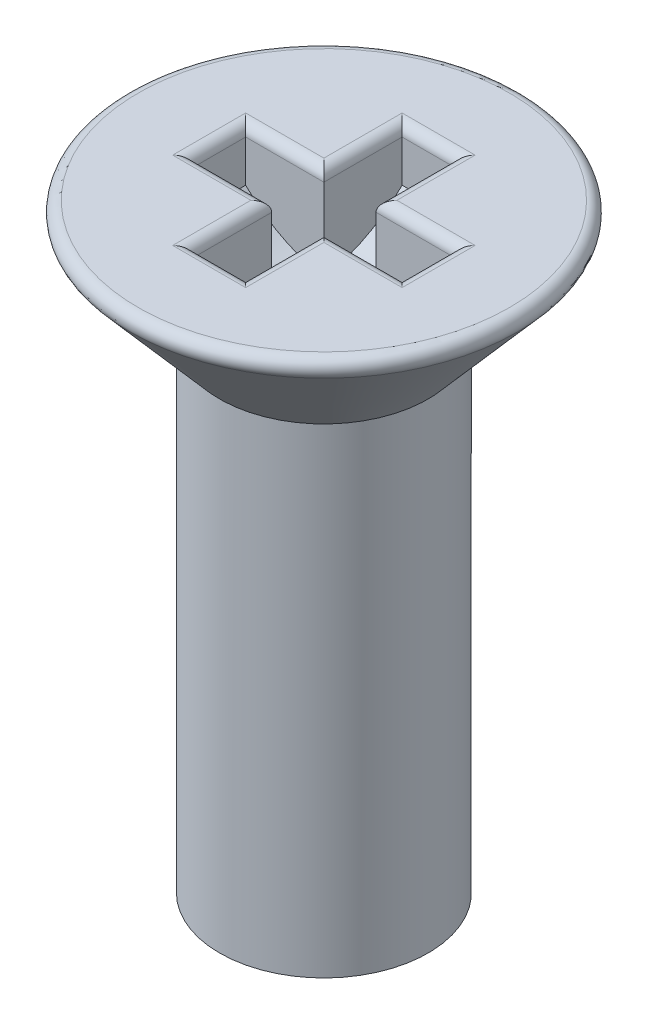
ISO-10303-21;
HEADER;
FILE_DESCRIPTION(('STEP AP214'),'2;1');
FILE_NAME('part.step','',(''),(''),'','','');
FILE_SCHEMA(('AUTOMOTIVE_DESIGN { 1 0 10303 214 1 1 1 1 }'));
ENDSEC;
DATA;
#1=APPLICATION_CONTEXT('core data for automotive mechanical design processes');
#2=APPLICATION_PROTOCOL_DEFINITION('international standard','automotive_design',2000,#1);
#3=PRODUCT_CONTEXT('',#1,'mechanical');
#4=PRODUCT('Part','Part','',(#3));
#5=PRODUCT_RELATED_PRODUCT_CATEGORY('part','',(#4));
#6=PRODUCT_DEFINITION_FORMATION('','',#4);
#7=PRODUCT_DEFINITION_CONTEXT('part definition',#1,'design');
#8=PRODUCT_DEFINITION('design','',#6,#7);
#9=PRODUCT_DEFINITION_SHAPE('','',#8);
#10=(LENGTH_UNIT() NAMED_UNIT(*) SI_UNIT(.MILLI.,.METRE.));
#11=(NAMED_UNIT(*) PLANE_ANGLE_UNIT() SI_UNIT($,.RADIAN.));
#12=(NAMED_UNIT(*) SI_UNIT($,.STERADIAN.) SOLID_ANGLE_UNIT());
#13=UNCERTAINTY_MEASURE_WITH_UNIT(LENGTH_MEASURE(1.E-05),#10,'distance_accuracy_value','');
#14=(GEOMETRIC_REPRESENTATION_CONTEXT(3) GLOBAL_UNCERTAINTY_ASSIGNED_CONTEXT((#13)) GLOBAL_UNIT_ASSIGNED_CONTEXT((#10,
#11,#12)) REPRESENTATION_CONTEXT('',''));
#15=CARTESIAN_POINT('',(0.,0.,0.));
#16=DIRECTION('',(0.,0.,1.));
#17=DIRECTION('',(1.,0.,0.));
#18=AXIS2_PLACEMENT_3D('',#15,#16,#17);
#19=CARTESIAN_POINT('',(20.5,44.5,0.));
#20=DIRECTION('',(0.,-1.,0.));
#21=DIRECTION('',(1.,0.,0.));
#22=AXIS2_PLACEMENT_3D('',#19,#20,#21);
#23=PLANE('',#22);
#24=DIRECTION('',(1.,0.,0.));
#25=VECTOR('',#24,1.);
#26=CARTESIAN_POINT('',(20.5,44.5,-2.2));
#27=LINE('',#26,#25);
#28=CARTESIAN_POINT('',(15.8,44.5,-2.2));
#29=VERTEX_POINT('',#28);
#30=CARTESIAN_POINT('',(17.2,44.5,-2.2));
#31=VERTEX_POINT('',#30);
#32=EDGE_CURVE('E302',#29,#31,#27,.T.);
#33=ORIENTED_EDGE('',*,*,#32,.T.);
#34=DIRECTION('',(0.,0.,1.));
#35=VECTOR('',#34,1.);
#36=CARTESIAN_POINT('',(17.2,44.5,0.));
#37=LINE('',#36,#35);
#38=CARTESIAN_POINT('',(17.2,44.5,-0.699999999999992));
#39=VERTEX_POINT('',#38);
#40=EDGE_CURVE('E304',#31,#39,#37,.T.);
#41=ORIENTED_EDGE('',*,*,#40,.T.);
#42=DIRECTION('',(-1.,0.,0.));
#43=VECTOR('',#42,1.);
#44=CARTESIAN_POINT('',(16.5,44.5,-0.699999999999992));
#45=LINE('',#44,#43);
#46=CARTESIAN_POINT('',(18.7,44.5,-0.699999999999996));
#47=VERTEX_POINT('',#46);
#48=EDGE_CURVE('E282',#39,#47,#45,.F.);
#49=ORIENTED_EDGE('',*,*,#48,.T.);
#50=DIRECTION('',(0.,0.,1.));
#51=VECTOR('',#50,1.);
#52=CARTESIAN_POINT('',(18.7,44.5,0.));
#53=LINE('',#52,#51);
#54=CARTESIAN_POINT('',(18.7,44.5,0.700000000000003));
#55=VERTEX_POINT('',#54);
#56=EDGE_CURVE('E284',#47,#55,#53,.T.);
#57=ORIENTED_EDGE('',*,*,#56,.T.);
#58=DIRECTION('',(-1.,0.,0.));
#59=VECTOR('',#58,1.);
#60=CARTESIAN_POINT('',(20.5,44.5,0.699999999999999));
#61=LINE('',#60,#59);
#62=CARTESIAN_POINT('',(17.2,44.5,0.699999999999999));
#63=VERTEX_POINT('',#62);
#64=EDGE_CURVE('E286',#55,#63,#61,.T.);
#65=ORIENTED_EDGE('',*,*,#64,.T.);
#66=DIRECTION('',(0.,0.,1.));
#67=VECTOR('',#66,1.);
#68=CARTESIAN_POINT('',(17.2,44.5,0.));
#69=LINE('',#68,#67);
#70=CARTESIAN_POINT('',(17.2,44.5,2.2));
#71=VERTEX_POINT('',#70);
#72=EDGE_CURVE('E288',#63,#71,#69,.T.);
#73=ORIENTED_EDGE('',*,*,#72,.T.);
#74=DIRECTION('',(1.,0.,0.));
#75=VECTOR('',#74,1.);
#76=CARTESIAN_POINT('',(20.5,44.5,2.2));
#77=LINE('',#76,#75);
#78=CARTESIAN_POINT('',(15.8,44.5,2.2));
#79=VERTEX_POINT('',#78);
#80=EDGE_CURVE('E290',#71,#79,#77,.F.);
#81=ORIENTED_EDGE('',*,*,#80,.T.);
#82=DIRECTION('',(0.,0.,1.));
#83=VECTOR('',#82,1.);
#84=CARTESIAN_POINT('',(15.8,44.5,0.));
#85=LINE('',#84,#83);
#86=CARTESIAN_POINT('',(15.8,44.5,0.699999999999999));
#87=VERTEX_POINT('',#86);
#88=EDGE_CURVE('E292',#79,#87,#85,.F.);
#89=ORIENTED_EDGE('',*,*,#88,.T.);
#90=DIRECTION('',(-1.,0.,0.));
#91=VECTOR('',#90,1.);
#92=CARTESIAN_POINT('',(20.5,44.5,0.699999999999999));
#93=LINE('',#92,#91);
#94=CARTESIAN_POINT('',(14.3,44.5,0.700000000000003));
#95=VERTEX_POINT('',#94);
#96=EDGE_CURVE('E294',#87,#95,#93,.T.);
#97=ORIENTED_EDGE('',*,*,#96,.T.);
#98=DIRECTION('',(0.,0.,1.));
#99=VECTOR('',#98,1.);
#100=CARTESIAN_POINT('',(14.3,44.5,0.));
#101=LINE('',#100,#99);
#102=CARTESIAN_POINT('',(14.3,44.5,-0.699999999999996));
#103=VERTEX_POINT('',#102);
#104=EDGE_CURVE('E296',#95,#103,#101,.F.);
#105=ORIENTED_EDGE('',*,*,#104,.T.);
#106=DIRECTION('',(-1.,0.,0.));
#107=VECTOR('',#106,1.);
#108=CARTESIAN_POINT('',(16.5,44.5,-0.699999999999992));
#109=LINE('',#108,#107);
#110=CARTESIAN_POINT('',(15.8,44.5,-0.699999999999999));
#111=VERTEX_POINT('',#110);
#112=EDGE_CURVE('E298',#103,#111,#109,.F.);
#113=ORIENTED_EDGE('',*,*,#112,.T.);
#114=DIRECTION('',(0.,0.,1.));
#115=VECTOR('',#114,1.);
#116=CARTESIAN_POINT('',(15.8,44.5,0.));
#117=LINE('',#116,#115);
#118=EDGE_CURVE('E300',#111,#29,#117,.F.);
#119=ORIENTED_EDGE('',*,*,#118,.T.);
#120=EDGE_LOOP('',(#33,#41,#49,#57,#65,#73,#81,#89,#97,#105,#113,#119));
#121=FACE_BOUND('',#120,.T.);
#122=CARTESIAN_POINT('',(16.5,44.5,0.));
#123=DIRECTION('',(0.,-1.,0.));
#124=DIRECTION('',(1.,0.,0.));
#125=AXIS2_PLACEMENT_3D('',#122,#123,#124);
#126=CIRCLE('',#125,3.56114005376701);
#127=CARTESIAN_POINT('',(20.061140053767,44.5,0.));
#128=VERTEX_POINT('',#127);
#129=EDGE_CURVE('E274',#128,#128,#126,.F.);
#130=ORIENTED_EDGE('',*,*,#129,.T.);
#131=EDGE_LOOP('',(#130));
#132=FACE_BOUND('',#131,.T.);
#133=ADVANCED_FACE('F24',(#121,#132),#23,.F.);
#134=CARTESIAN_POINT('',(16.,45.5,0.));
#135=DIRECTION('',(1.,0.,0.));
#136=DIRECTION('',(0.,0.,-1.));
#137=AXIS2_PLACEMENT_3D('',#134,#135,#136);
#138=CYLINDRICAL_SURFACE('',#137,2.82842712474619);
#139=DIRECTION('',(1.,0.,0.));
#140=VECTOR('',#139,1.);
#141=CARTESIAN_POINT('',(16.,42.716117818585,-0.499999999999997));
#142=LINE('',#141,#140);
#143=CARTESIAN_POINT('',(17.,42.716117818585,-0.499999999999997));
#144=VERTEX_POINT('',#143);
#145=CARTESIAN_POINT('',(16.,42.716117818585,-0.499999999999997));
#146=VERTEX_POINT('',#145);
#147=EDGE_CURVE('E477',#144,#146,#142,.F.);
#148=ORIENTED_EDGE('',*,*,#147,.F.);
#149=CARTESIAN_POINT('',(17.,45.5,0.));
#150=DIRECTION('',(1.,0.,0.));
#151=DIRECTION('',(0.,0.,-1.));
#152=AXIS2_PLACEMENT_3D('',#149,#150,#151);
#153=CIRCLE('',#152,2.82842712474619);
#154=CARTESIAN_POINT('',(17.,43.5,-2.));
#155=VERTEX_POINT('',#154);
#156=EDGE_CURVE('E370',#144,#155,#153,.T.);
#157=ORIENTED_EDGE('',*,*,#156,.T.);
#158=DIRECTION('',(1.,0.,0.));
#159=VECTOR('',#158,1.);
#160=CARTESIAN_POINT('',(16.,43.5,-2.));
#161=LINE('',#160,#159);
#162=CARTESIAN_POINT('',(16.,43.5,-2.));
#163=VERTEX_POINT('',#162);
#164=EDGE_CURVE('E262',#163,#155,#161,.T.);
#165=ORIENTED_EDGE('',*,*,#164,.F.);
#166=CARTESIAN_POINT('',(16.,45.5,0.));
#167=DIRECTION('',(1.,0.,0.));
#168=DIRECTION('',(0.,0.,-1.));
#169=AXIS2_PLACEMENT_3D('',#166,#167,#168);
#170=CIRCLE('',#169,2.82842712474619);
#171=EDGE_CURVE('E393',#146,#163,#170,.T.);
#172=ORIENTED_EDGE('',*,*,#171,.F.);
#173=EDGE_LOOP('',(#148,#157,#165,#172));
#174=FACE_BOUND('',#173,.T.);
#175=ADVANCED_FACE('F227',(#174),#138,.F.);
#176=CARTESIAN_POINT('',(16.,45.5,0.));
#177=DIRECTION('',(1.,0.,0.));
#178=DIRECTION('',(0.,0.,-1.));
#179=AXIS2_PLACEMENT_3D('',#176,#177,#178);
#180=PLANE('',#179);
#181=DIRECTION('',(0.,1.,0.));
#182=VECTOR('',#181,1.);
#183=CARTESIAN_POINT('',(16.,44.5,-2.));
#184=LINE('',#183,#182);
#185=CARTESIAN_POINT('',(16.,44.3,-2.));
#186=VERTEX_POINT('',#185);
#187=EDGE_CURVE('E387',#163,#186,#184,.T.);
#188=ORIENTED_EDGE('',*,*,#187,.T.);
#189=DIRECTION('',(0.,0.,1.));
#190=VECTOR('',#189,1.);
#191=CARTESIAN_POINT('',(16.,44.3,0.));
#192=LINE('',#191,#190);
#193=CARTESIAN_POINT('',(16.,44.3,-0.499999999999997));
#194=VERTEX_POINT('',#193);
#195=EDGE_CURVE('E312',#186,#194,#192,.T.);
#196=ORIENTED_EDGE('',*,*,#195,.T.);
#197=DIRECTION('',(0.,-1.,0.));
#198=VECTOR('',#197,1.);
#199=CARTESIAN_POINT('',(16.,45.5,-0.499999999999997));
#200=LINE('',#199,#198);
#201=EDGE_CURVE('E466',#194,#146,#200,.T.);
#202=ORIENTED_EDGE('',*,*,#201,.T.);
#203=ORIENTED_EDGE('',*,*,#171,.T.);
#204=EDGE_LOOP('',(#188,#196,#202,#203));
#205=FACE_BOUND('',#204,.T.);
#206=ADVANCED_FACE('F233',(#205),#180,.T.);
#207=CARTESIAN_POINT('',(17.,45.5,0.));
#208=DIRECTION('',(1.,0.,0.));
#209=DIRECTION('',(0.,0.,-1.));
#210=AXIS2_PLACEMENT_3D('',#207,#208,#209);
#211=PLANE('',#210);
#212=DIRECTION('',(0.,-1.,0.));
#213=VECTOR('',#212,1.);
#214=CARTESIAN_POINT('',(17.,45.5,-0.499999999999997));
#215=LINE('',#214,#213);
#216=CARTESIAN_POINT('',(17.,44.3,-0.499999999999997));
#217=VERTEX_POINT('',#216);
#218=EDGE_CURVE('E280',#217,#144,#215,.T.);
#219=ORIENTED_EDGE('',*,*,#218,.F.);
#220=DIRECTION('',(0.,0.,1.));
#221=VECTOR('',#220,1.);
#222=CARTESIAN_POINT('',(17.,44.3,0.));
#223=LINE('',#222,#221);
#224=CARTESIAN_POINT('',(17.,44.3,-2.));
#225=VERTEX_POINT('',#224);
#226=EDGE_CURVE('E307',#217,#225,#223,.F.);
#227=ORIENTED_EDGE('',*,*,#226,.T.);
#228=DIRECTION('',(0.,1.,0.));
#229=VECTOR('',#228,1.);
#230=CARTESIAN_POINT('',(17.,44.5,-2.));
#231=LINE('',#230,#229);
#232=EDGE_CURVE('E388',#155,#225,#231,.T.);
#233=ORIENTED_EDGE('',*,*,#232,.F.);
#234=ORIENTED_EDGE('',*,*,#156,.F.);
#235=EDGE_LOOP('',(#219,#227,#233,#234));
#236=FACE_BOUND('',#235,.T.);
#237=ADVANCED_FACE('F251',(#236),#211,.F.);
#238=CARTESIAN_POINT('',(16.5,50.,0.));
#239=DIRECTION('',(0.,1.,0.));
#240=DIRECTION('',(-1.,0.,0.));
#241=AXIS2_PLACEMENT_3D('',#238,#239,#240);
#242=CYLINDRICAL_SURFACE('',#241,2.00000000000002);
#243=CARTESIAN_POINT('',(16.5,33.,0.));
#244=DIRECTION('',(0.,1.,0.));
#245=DIRECTION('',(0.,0.,1.));
#246=AXIS2_PLACEMENT_3D('',#243,#244,#245);
#247=CIRCLE('',#246,2.00000000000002);
#248=CARTESIAN_POINT('',(16.5,33.,2.00000000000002));
#249=VERTEX_POINT('',#248);
#250=EDGE_CURVE('E261',#249,#249,#247,.T.);
#251=ORIENTED_EDGE('',*,*,#250,.T.);
#252=EDGE_LOOP('',(#251));
#253=FACE_BOUND('',#252,.T.);
#254=CARTESIAN_POINT('',(16.5,42.199263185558,0.));
#255=DIRECTION('',(0.,1.,0.));
#256=DIRECTION('',(-1.,0.,0.));
#257=AXIS2_PLACEMENT_3D('',#254,#255,#256);
#258=CIRCLE('',#257,2.00000000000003);
#259=CARTESIAN_POINT('',(14.5,42.199263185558,0.));
#260=VERTEX_POINT('',#259);
#261=EDGE_CURVE('E259',#260,#260,#258,.T.);
#262=ORIENTED_EDGE('',*,*,#261,.F.);
#263=EDGE_LOOP('',(#262));
#264=FACE_BOUND('',#263,.T.);
#265=ADVANCED_FACE('F26',(#253,#264),#242,.T.);
#266=CARTESIAN_POINT('',(16.5,42.199263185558,0.));
#267=DIRECTION('',(0.,1.,0.));
#268=DIRECTION('',(-1.,0.,0.));
#269=AXIS2_PLACEMENT_3D('',#266,#267,#268);
#270=CONICAL_SURFACE('',#269,2.00000000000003,0.715584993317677);
#271=CARTESIAN_POINT('',(16.5,44.1687881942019,0.));
#272=DIRECTION('',(0.,-1.,0.));
#273=DIRECTION('',(1.,0.,0.));
#274=AXIS2_PLACEMENT_3D('',#271,#272,#273);
#275=CIRCLE('',#274,3.71208196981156);
#276=CARTESIAN_POINT('',(20.2120819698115,44.1687881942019,0.));
#277=VERTEX_POINT('',#276);
#278=EDGE_CURVE('E256',#277,#277,#275,.T.);
#279=ORIENTED_EDGE('',*,*,#278,.T.);
#280=EDGE_LOOP('',(#279));
#281=FACE_BOUND('',#280,.T.);
#282=ORIENTED_EDGE('',*,*,#261,.T.);
#283=EDGE_LOOP('',(#282));
#284=FACE_BOUND('',#283,.T.);
#285=ADVANCED_FACE('F242',(#281,#284),#270,.T.);
#286=CARTESIAN_POINT('',(18.5,32.5,0.));
#287=DIRECTION('',(0.,1.,0.));
#288=DIRECTION('',(-1.,0.,0.));
#289=AXIS2_PLACEMENT_3D('',#286,#287,#288);
#290=PLANE('',#289);
#291=CARTESIAN_POINT('',(16.5,32.5,0.));
#292=DIRECTION('',(0.,1.,0.));
#293=DIRECTION('',(-1.,0.,0.));
#294=AXIS2_PLACEMENT_3D('',#291,#292,#293);
#295=CIRCLE('',#294,1.13397459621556);
#296=CARTESIAN_POINT('',(15.3660254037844,32.5,0.));
#297=VERTEX_POINT('',#296);
#298=EDGE_CURVE('E265',#297,#297,#295,.F.);
#299=ORIENTED_EDGE('',*,*,#298,.T.);
#300=EDGE_LOOP('',(#299));
#301=FACE_BOUND('',#300,.T.);
#302=ADVANCED_FACE('F240',(#301),#290,.F.);
#303=CARTESIAN_POINT('',(16.5,33.,0.));
#304=DIRECTION('',(0.,1.,0.));
#305=DIRECTION('',(0.,0.,1.));
#306=AXIS2_PLACEMENT_3D('',#303,#304,#305);
#307=CONICAL_SURFACE('',#306,2.00000000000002,1.0471975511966);
#308=ORIENTED_EDGE('',*,*,#298,.F.);
#309=EDGE_LOOP('',(#308));
#310=FACE_BOUND('',#309,.T.);
#311=ORIENTED_EDGE('',*,*,#250,.F.);
#312=EDGE_LOOP('',(#311));
#313=FACE_BOUND('',#312,.T.);
#314=ADVANCED_FACE('F249',(#310,#313),#307,.T.);
#315=CARTESIAN_POINT('',(16.,44.5,2.));
#316=DIRECTION('',(0.,0.,1.));
#317=DIRECTION('',(0.,-1.,0.));
#318=AXIS2_PLACEMENT_3D('',#315,#316,#317);
#319=PLANE('',#318);
#320=DIRECTION('',(0.,-1.,0.));
#321=VECTOR('',#320,1.);
#322=CARTESIAN_POINT('',(16.,44.5,2.));
#323=LINE('',#322,#321);
#324=CARTESIAN_POINT('',(16.,44.3,2.));
#325=VERTEX_POINT('',#324);
#326=CARTESIAN_POINT('',(16.,43.5,2.00000000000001));
#327=VERTEX_POINT('',#326);
#328=EDGE_CURVE('E432',#325,#327,#323,.T.);
#329=ORIENTED_EDGE('',*,*,#328,.F.);
#330=DIRECTION('',(1.,0.,0.));
#331=VECTOR('',#330,1.);
#332=CARTESIAN_POINT('',(16.,44.3,2.));
#333=LINE('',#332,#331);
#334=CARTESIAN_POINT('',(17.,44.3,2.));
#335=VERTEX_POINT('',#334);
#336=EDGE_CURVE('E321',#325,#335,#333,.T.);
#337=ORIENTED_EDGE('',*,*,#336,.T.);
#338=DIRECTION('',(0.,-1.,0.));
#339=VECTOR('',#338,1.);
#340=CARTESIAN_POINT('',(17.,44.5,2.));
#341=LINE('',#340,#339);
#342=CARTESIAN_POINT('',(17.,43.5,2.));
#343=VERTEX_POINT('',#342);
#344=EDGE_CURVE('E331',#335,#343,#341,.T.);
#345=ORIENTED_EDGE('',*,*,#344,.T.);
#346=DIRECTION('',(1.,0.,0.));
#347=VECTOR('',#346,1.);
#348=CARTESIAN_POINT('',(16.,43.5,2.00000000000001));
#349=LINE('',#348,#347);
#350=EDGE_CURVE('E268',#327,#343,#349,.T.);
#351=ORIENTED_EDGE('',*,*,#350,.F.);
#352=EDGE_LOOP('',(#329,#337,#345,#351));
#353=FACE_BOUND('',#352,.T.);
#354=ADVANCED_FACE('F435',(#353),#319,.F.);
#355=CARTESIAN_POINT('',(16.,44.5,-2.));
#356=DIRECTION('',(0.,0.,-1.));
#357=DIRECTION('',(0.,1.,0.));
#358=AXIS2_PLACEMENT_3D('',#355,#356,#357);
#359=PLANE('',#358);
#360=ORIENTED_EDGE('',*,*,#232,.T.);
#361=DIRECTION('',(1.,0.,0.));
#362=VECTOR('',#361,1.);
#363=CARTESIAN_POINT('',(16.,44.3,-2.));
#364=LINE('',#363,#362);
#365=EDGE_CURVE('E310',#225,#186,#364,.F.);
#366=ORIENTED_EDGE('',*,*,#365,.T.);
#367=ORIENTED_EDGE('',*,*,#187,.F.);
#368=ORIENTED_EDGE('',*,*,#164,.T.);
#369=EDGE_LOOP('',(#360,#366,#367,#368));
#370=FACE_BOUND('',#369,.T.);
#371=ADVANCED_FACE('F386',(#370),#359,.F.);
#372=CARTESIAN_POINT('',(17.,42.716117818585,0.500000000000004));
#373=VERTEX_POINT('',#372);
#374=EDGE_CURVE('E441',#343,#373,#153,.T.);
#375=ORIENTED_EDGE('',*,*,#374,.T.);
#376=DIRECTION('',(1.,0.,0.));
#377=VECTOR('',#376,1.);
#378=CARTESIAN_POINT('',(16.,42.716117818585,0.500000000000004));
#379=LINE('',#378,#377);
#380=CARTESIAN_POINT('',(16.,42.716117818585,0.500000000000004));
#381=VERTEX_POINT('',#380);
#382=EDGE_CURVE('E200',#373,#381,#379,.F.);
#383=ORIENTED_EDGE('',*,*,#382,.T.);
#384=EDGE_CURVE('E395',#327,#381,#170,.T.);
#385=ORIENTED_EDGE('',*,*,#384,.F.);
#386=ORIENTED_EDGE('',*,*,#350,.T.);
#387=EDGE_LOOP('',(#375,#383,#385,#386));
#388=FACE_BOUND('',#387,.T.);
#389=ADVANCED_FACE('F237',(#388),#138,.F.);
#390=DIRECTION('',(0.,-1.,0.));
#391=VECTOR('',#390,1.);
#392=CARTESIAN_POINT('',(16.,45.5,0.500000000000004));
#393=LINE('',#392,#391);
#394=CARTESIAN_POINT('',(16.,44.3,0.500000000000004));
#395=VERTEX_POINT('',#394);
#396=EDGE_CURVE('E180',#395,#381,#393,.T.);
#397=ORIENTED_EDGE('',*,*,#396,.F.);
#398=DIRECTION('',(0.,0.,1.));
#399=VECTOR('',#398,1.);
#400=CARTESIAN_POINT('',(16.,44.3,0.));
#401=LINE('',#400,#399);
#402=EDGE_CURVE('E319',#395,#325,#401,.T.);
#403=ORIENTED_EDGE('',*,*,#402,.T.);
#404=ORIENTED_EDGE('',*,*,#328,.T.);
#405=ORIENTED_EDGE('',*,*,#384,.T.);
#406=EDGE_LOOP('',(#397,#403,#404,#405));
#407=FACE_BOUND('',#406,.T.);
#408=ADVANCED_FACE('F431',(#407),#180,.T.);
#409=ORIENTED_EDGE('',*,*,#344,.F.);
#410=DIRECTION('',(0.,0.,1.));
#411=VECTOR('',#410,1.);
#412=CARTESIAN_POINT('',(17.,44.3,0.));
#413=LINE('',#412,#411);
#414=CARTESIAN_POINT('',(17.,44.3,0.500000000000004));
#415=VERTEX_POINT('',#414);
#416=EDGE_CURVE('E323',#335,#415,#413,.F.);
#417=ORIENTED_EDGE('',*,*,#416,.T.);
#418=DIRECTION('',(0.,-1.,0.));
#419=VECTOR('',#418,1.);
#420=CARTESIAN_POINT('',(17.,45.5,0.500000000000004));
#421=LINE('',#420,#419);
#422=EDGE_CURVE('E203',#415,#373,#421,.T.);
#423=ORIENTED_EDGE('',*,*,#422,.T.);
#424=ORIENTED_EDGE('',*,*,#374,.F.);
#425=EDGE_LOOP('',(#409,#417,#423,#424));
#426=FACE_BOUND('',#425,.T.);
#427=ADVANCED_FACE('F328',(#426),#211,.F.);
#428=CARTESIAN_POINT('',(16.5,44.3,0.));
#429=DIRECTION('',(0.,-1.,0.));
#430=DIRECTION('',(1.,0.,0.));
#431=AXIS2_PLACEMENT_3D('',#428,#429,#430);
#432=TOROIDAL_SURFACE('',#431,3.56114005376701,0.2);
#433=ORIENTED_EDGE('',*,*,#278,.F.);
#434=EDGE_LOOP('',(#433));
#435=FACE_BOUND('',#434,.T.);
#436=ORIENTED_EDGE('',*,*,#129,.F.);
#437=EDGE_LOOP('',(#436));
#438=FACE_BOUND('',#437,.T.);
#439=ADVANCED_FACE('F215',(#435,#438),#432,.T.);
#440=CARTESIAN_POINT('',(16.5,45.5,-0.499999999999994));
#441=DIRECTION('',(0.,0.,1.));
#442=DIRECTION('',(1.,0.,0.));
#443=AXIS2_PLACEMENT_3D('',#440,#441,#442);
#444=PLANE('',#443);
#445=DIRECTION('',(0.,1.,0.));
#446=VECTOR('',#445,1.);
#447=CARTESIAN_POINT('',(18.5,44.5,-0.499999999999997));
#448=LINE('',#447,#446);
#449=CARTESIAN_POINT('',(18.5,43.5,-0.499999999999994));
#450=VERTEX_POINT('',#449);
#451=CARTESIAN_POINT('',(18.5,44.3,-0.499999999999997));
#452=VERTEX_POINT('',#451);
#453=EDGE_CURVE('E176',#450,#452,#448,.T.);
#454=ORIENTED_EDGE('',*,*,#453,.T.);
#455=DIRECTION('',(-1.,0.,0.));
#456=VECTOR('',#455,1.);
#457=CARTESIAN_POINT('',(16.5,44.3,-0.499999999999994));
#458=LINE('',#457,#456);
#459=EDGE_CURVE('E11',#452,#217,#458,.T.);
#460=ORIENTED_EDGE('',*,*,#459,.T.);
#461=ORIENTED_EDGE('',*,*,#218,.T.);
#462=CARTESIAN_POINT('',(16.5,45.5,-0.499999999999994));
#463=DIRECTION('',(0.,0.,1.));
#464=DIRECTION('',(1.,0.,0.));
#465=AXIS2_PLACEMENT_3D('',#462,#463,#464);
#466=CIRCLE('',#465,2.82842712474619);
#467=EDGE_CURVE('E481',#144,#450,#466,.T.);
#468=ORIENTED_EDGE('',*,*,#467,.T.);
#469=EDGE_LOOP('',(#454,#460,#461,#468));
#470=FACE_BOUND('',#469,.T.);
#471=ADVANCED_FACE('F206',(#470),#444,.T.);
#472=CARTESIAN_POINT('',(16.5,45.5,0.5));
#473=DIRECTION('',(0.,0.,1.));
#474=DIRECTION('',(1.,0.,0.));
#475=AXIS2_PLACEMENT_3D('',#472,#473,#474);
#476=PLANE('',#475);
#477=ORIENTED_EDGE('',*,*,#422,.F.);
#478=DIRECTION('',(-1.,0.,0.));
#479=VECTOR('',#478,1.);
#480=CARTESIAN_POINT('',(16.5,44.3,0.5));
#481=LINE('',#480,#479);
#482=CARTESIAN_POINT('',(18.5,44.3,0.500000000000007));
#483=VERTEX_POINT('',#482);
#484=EDGE_CURVE('E46',#415,#483,#481,.F.);
#485=ORIENTED_EDGE('',*,*,#484,.T.);
#486=DIRECTION('',(0.,1.,0.));
#487=VECTOR('',#486,1.);
#488=CARTESIAN_POINT('',(18.5,44.5,0.500000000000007));
#489=LINE('',#488,#487);
#490=CARTESIAN_POINT('',(18.5,43.5,0.500000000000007));
#491=VERTEX_POINT('',#490);
#492=EDGE_CURVE('E182',#491,#483,#489,.T.);
#493=ORIENTED_EDGE('',*,*,#492,.F.);
#494=CARTESIAN_POINT('',(16.5,45.5,0.5));
#495=DIRECTION('',(0.,0.,1.));
#496=DIRECTION('',(1.,0.,0.));
#497=AXIS2_PLACEMENT_3D('',#494,#495,#496);
#498=CIRCLE('',#497,2.82842712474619);
#499=EDGE_CURVE('E164',#373,#491,#498,.T.);
#500=ORIENTED_EDGE('',*,*,#499,.F.);
#501=EDGE_LOOP('',(#477,#485,#493,#500));
#502=FACE_BOUND('',#501,.T.);
#503=ADVANCED_FACE('F202',(#502),#476,.F.);
#504=CARTESIAN_POINT('',(16.5,45.5,-0.499999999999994));
#505=DIRECTION('',(0.,0.,1.));
#506=DIRECTION('',(1.,0.,0.));
#507=AXIS2_PLACEMENT_3D('',#504,#505,#506);
#508=CYLINDRICAL_SURFACE('',#507,2.82842712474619);
#509=ORIENTED_EDGE('',*,*,#499,.T.);
#510=DIRECTION('',(0.,0.,1.));
#511=VECTOR('',#510,1.);
#512=CARTESIAN_POINT('',(18.5,43.5,-0.499999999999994));
#513=LINE('',#512,#511);
#514=EDGE_CURVE('E175',#450,#491,#513,.T.);
#515=ORIENTED_EDGE('',*,*,#514,.F.);
#516=ORIENTED_EDGE('',*,*,#467,.F.);
#517=DIRECTION('',(0.,0.,1.));
#518=VECTOR('',#517,1.);
#519=CARTESIAN_POINT('',(17.,42.716117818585,-0.499999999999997));
#520=LINE('',#519,#518);
#521=EDGE_CURVE('E196',#373,#144,#520,.F.);
#522=ORIENTED_EDGE('',*,*,#521,.F.);
#523=EDGE_LOOP('',(#509,#515,#516,#522));
#524=FACE_BOUND('',#523,.T.);
#525=ADVANCED_FACE('F193',(#524),#508,.F.);
#526=CARTESIAN_POINT('',(18.5,44.5,-0.499999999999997));
#527=DIRECTION('',(1.,0.,0.));
#528=DIRECTION('',(0.,0.,-1.));
#529=AXIS2_PLACEMENT_3D('',#526,#527,#528);
#530=PLANE('',#529);
#531=ORIENTED_EDGE('',*,*,#492,.T.);
#532=DIRECTION('',(0.,0.,1.));
#533=VECTOR('',#532,1.);
#534=CARTESIAN_POINT('',(18.5,44.3,-0.499999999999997));
#535=LINE('',#534,#533);
#536=EDGE_CURVE('E32',#483,#452,#535,.F.);
#537=ORIENTED_EDGE('',*,*,#536,.T.);
#538=ORIENTED_EDGE('',*,*,#453,.F.);
#539=ORIENTED_EDGE('',*,*,#514,.T.);
#540=EDGE_LOOP('',(#531,#537,#538,#539));
#541=FACE_BOUND('',#540,.T.);
#542=ADVANCED_FACE('F198',(#541),#530,.F.);
#543=EDGE_CURVE('E472',#373,#144,#153,.T.);
#544=ORIENTED_EDGE('',*,*,#543,.F.);
#545=ORIENTED_EDGE('',*,*,#521,.T.);
#546=EDGE_LOOP('',(#544,#545));
#547=FACE_BOUND('',#546,.T.);
#548=ADVANCED_FACE('F486',(#547),#211,.F.);
#549=ORIENTED_EDGE('',*,*,#543,.T.);
#550=CARTESIAN_POINT('',(16.5,45.5,0.));
#551=DIRECTION('',(0.707106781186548,0.,0.707106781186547));
#552=DIRECTION('',(0.707106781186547,0.,-0.707106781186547));
#553=AXIS2_PLACEMENT_3D('',#550,#551,#552);
#554=ELLIPSE('',#553,4.,2.82842712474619);
#555=CARTESIAN_POINT('',(16.5,42.6715728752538,0.));
#556=VERTEX_POINT('',#555);
#557=EDGE_CURVE('E460',#144,#556,#554,.F.);
#558=ORIENTED_EDGE('',*,*,#557,.T.);
#559=CARTESIAN_POINT('',(16.5,45.5,0.));
#560=DIRECTION('',(0.707106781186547,0.,-0.707106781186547));
#561=DIRECTION('',(0.707106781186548,0.,0.707106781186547));
#562=AXIS2_PLACEMENT_3D('',#559,#560,#561);
#563=ELLIPSE('',#562,4.,2.82842712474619);
#564=EDGE_CURVE('E461',#556,#373,#563,.F.);
#565=ORIENTED_EDGE('',*,*,#564,.T.);
#566=EDGE_LOOP('',(#549,#558,#565));
#567=FACE_BOUND('',#566,.T.);
#568=ADVANCED_FACE('F236',(#567),#138,.F.);
#569=ORIENTED_EDGE('',*,*,#201,.F.);
#570=DIRECTION('',(-1.,0.,0.));
#571=VECTOR('',#570,1.);
#572=CARTESIAN_POINT('',(16.5,44.3,-0.499999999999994));
#573=LINE('',#572,#571);
#574=CARTESIAN_POINT('',(14.5,44.3,-0.5));
#575=VERTEX_POINT('',#574);
#576=EDGE_CURVE('E314',#194,#575,#573,.T.);
#577=ORIENTED_EDGE('',*,*,#576,.T.);
#578=DIRECTION('',(0.,-1.,0.));
#579=VECTOR('',#578,1.);
#580=CARTESIAN_POINT('',(14.5,44.5,-0.5));
#581=LINE('',#580,#579);
#582=CARTESIAN_POINT('',(14.5,43.5,-0.5));
#583=VERTEX_POINT('',#582);
#584=EDGE_CURVE('E185',#575,#583,#581,.T.);
#585=ORIENTED_EDGE('',*,*,#584,.T.);
#586=EDGE_CURVE('E174',#583,#146,#466,.T.);
#587=ORIENTED_EDGE('',*,*,#586,.T.);
#588=EDGE_LOOP('',(#569,#577,#585,#587));
#589=FACE_BOUND('',#588,.T.);
#590=ADVANCED_FACE('F218',(#589),#444,.T.);
#591=DIRECTION('',(0.,-1.,0.));
#592=VECTOR('',#591,1.);
#593=CARTESIAN_POINT('',(14.5,44.5,0.500000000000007));
#594=LINE('',#593,#592);
#595=CARTESIAN_POINT('',(14.5,44.3,0.500000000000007));
#596=VERTEX_POINT('',#595);
#597=CARTESIAN_POINT('',(14.5,43.5,0.500000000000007));
#598=VERTEX_POINT('',#597);
#599=EDGE_CURVE('E153',#596,#598,#594,.T.);
#600=ORIENTED_EDGE('',*,*,#599,.F.);
#601=DIRECTION('',(-1.,0.,0.));
#602=VECTOR('',#601,1.);
#603=CARTESIAN_POINT('',(16.5,44.3,0.5));
#604=LINE('',#603,#602);
#605=EDGE_CURVE('E317',#596,#395,#604,.F.);
#606=ORIENTED_EDGE('',*,*,#605,.T.);
#607=ORIENTED_EDGE('',*,*,#396,.T.);
#608=EDGE_CURVE('E171',#598,#381,#498,.T.);
#609=ORIENTED_EDGE('',*,*,#608,.F.);
#610=EDGE_LOOP('',(#600,#606,#607,#609));
#611=FACE_BOUND('',#610,.T.);
#612=ADVANCED_FACE('F178',(#611),#476,.F.);
#613=DIRECTION('',(0.,0.,1.));
#614=VECTOR('',#613,1.);
#615=CARTESIAN_POINT('',(16.,42.716117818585,-0.499999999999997));
#616=LINE('',#615,#614);
#617=EDGE_CURVE('E451',#381,#146,#616,.F.);
#618=ORIENTED_EDGE('',*,*,#617,.T.);
#619=ORIENTED_EDGE('',*,*,#586,.F.);
#620=DIRECTION('',(0.,0.,1.));
#621=VECTOR('',#620,1.);
#622=CARTESIAN_POINT('',(14.5,43.5,-0.5));
#623=LINE('',#622,#621);
#624=EDGE_CURVE('E157',#583,#598,#623,.T.);
#625=ORIENTED_EDGE('',*,*,#624,.T.);
#626=ORIENTED_EDGE('',*,*,#608,.T.);
#627=EDGE_LOOP('',(#618,#619,#625,#626));
#628=FACE_BOUND('',#627,.T.);
#629=ADVANCED_FACE('F170',(#628),#508,.F.);
#630=CARTESIAN_POINT('',(14.5,44.5,-0.5));
#631=DIRECTION('',(-1.,0.,0.));
#632=DIRECTION('',(0.,0.,1.));
#633=AXIS2_PLACEMENT_3D('',#630,#631,#632);
#634=PLANE('',#633);
#635=ORIENTED_EDGE('',*,*,#584,.F.);
#636=DIRECTION('',(0.,0.,1.));
#637=VECTOR('',#636,1.);
#638=CARTESIAN_POINT('',(14.5,44.3,-0.5));
#639=LINE('',#638,#637);
#640=EDGE_CURVE('E160',#575,#596,#639,.T.);
#641=ORIENTED_EDGE('',*,*,#640,.T.);
#642=ORIENTED_EDGE('',*,*,#599,.T.);
#643=ORIENTED_EDGE('',*,*,#624,.F.);
#644=EDGE_LOOP('',(#635,#641,#642,#643));
#645=FACE_BOUND('',#644,.T.);
#646=ADVANCED_FACE('F156',(#645),#634,.F.);
#647=ORIENTED_EDGE('',*,*,#617,.F.);
#648=EDGE_CURVE('E439',#381,#146,#170,.T.);
#649=ORIENTED_EDGE('',*,*,#648,.T.);
#650=EDGE_LOOP('',(#647,#649));
#651=FACE_BOUND('',#650,.T.);
#652=ADVANCED_FACE('F450',(#651),#180,.T.);
#653=ORIENTED_EDGE('',*,*,#648,.F.);
#654=CARTESIAN_POINT('',(16.5,45.5,0.));
#655=DIRECTION('',(0.707106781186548,0.,0.707106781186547));
#656=DIRECTION('',(0.707106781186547,0.,-0.707106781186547));
#657=AXIS2_PLACEMENT_3D('',#654,#655,#656);
#658=ELLIPSE('',#657,4.,2.82842712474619);
#659=EDGE_CURVE('E455',#381,#556,#658,.T.);
#660=ORIENTED_EDGE('',*,*,#659,.T.);
#661=CARTESIAN_POINT('',(16.5,45.5,0.));
#662=DIRECTION('',(0.707106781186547,0.,-0.707106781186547));
#663=DIRECTION('',(0.707106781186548,0.,0.707106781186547));
#664=AXIS2_PLACEMENT_3D('',#661,#662,#663);
#665=ELLIPSE('',#664,4.,2.82842712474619);
#666=EDGE_CURVE('E454',#556,#146,#665,.T.);
#667=ORIENTED_EDGE('',*,*,#666,.T.);
#668=EDGE_LOOP('',(#653,#660,#667));
#669=FACE_BOUND('',#668,.T.);
#670=ADVANCED_FACE('F224',(#669),#138,.F.);
#671=EDGE_CURVE('E183',#381,#373,#498,.T.);
#672=ORIENTED_EDGE('',*,*,#671,.F.);
#673=ORIENTED_EDGE('',*,*,#382,.F.);
#674=EDGE_LOOP('',(#672,#673));
#675=FACE_BOUND('',#674,.T.);
#676=ADVANCED_FACE('F208',(#675),#476,.F.);
#677=ORIENTED_EDGE('',*,*,#671,.T.);
#678=ORIENTED_EDGE('',*,*,#564,.F.);
#679=ORIENTED_EDGE('',*,*,#659,.F.);
#680=EDGE_LOOP('',(#677,#678,#679));
#681=FACE_BOUND('',#680,.T.);
#682=ADVANCED_FACE('F223',(#681),#508,.F.);
#683=EDGE_CURVE('E482',#146,#144,#466,.T.);
#684=ORIENTED_EDGE('',*,*,#683,.F.);
#685=ORIENTED_EDGE('',*,*,#666,.F.);
#686=ORIENTED_EDGE('',*,*,#557,.F.);
#687=EDGE_LOOP('',(#684,#685,#686));
#688=FACE_BOUND('',#687,.T.);
#689=ADVANCED_FACE('F214',(#688),#508,.F.);
#690=ORIENTED_EDGE('',*,*,#147,.T.);
#691=ORIENTED_EDGE('',*,*,#683,.T.);
#692=EDGE_LOOP('',(#690,#691));
#693=FACE_BOUND('',#692,.T.);
#694=ADVANCED_FACE('F219',(#693),#444,.T.);
#695=CARTESIAN_POINT('',(15.8,44.3,0.));
#696=DIRECTION('',(0.,0.,-1.));
#697=DIRECTION('',(-1.,0.,0.));
#698=AXIS2_PLACEMENT_3D('',#695,#696,#697);
#699=CYLINDRICAL_SURFACE('',#698,0.2);
#700=CARTESIAN_POINT('',(15.8,44.3,2.2));
#701=DIRECTION('',(-0.707106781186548,0.,-0.707106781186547));
#702=DIRECTION('',(0.707106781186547,0.,-0.707106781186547));
#703=AXIS2_PLACEMENT_3D('',#700,#701,#702);
#704=ELLIPSE('',#703,0.282842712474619,0.2);
#705=EDGE_CURVE('E414',#325,#79,#704,.F.);
#706=ORIENTED_EDGE('',*,*,#705,.F.);
#707=ORIENTED_EDGE('',*,*,#402,.F.);
#708=CARTESIAN_POINT('',(15.8,44.3,0.699999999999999));
#709=DIRECTION('',(-0.707106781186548,0.,-0.707106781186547));
#710=DIRECTION('',(0.707106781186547,0.,-0.707106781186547));
#711=AXIS2_PLACEMENT_3D('',#708,#709,#710);
#712=ELLIPSE('',#711,0.282842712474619,0.2);
#713=EDGE_CURVE('E165',#87,#395,#712,.T.);
#714=ORIENTED_EDGE('',*,*,#713,.F.);
#715=ORIENTED_EDGE('',*,*,#88,.F.);
#716=EDGE_LOOP('',(#706,#707,#714,#715));
#717=FACE_BOUND('',#716,.T.);
#718=ADVANCED_FACE('F427',(#717),#699,.T.);
#719=CARTESIAN_POINT('',(20.5,44.3,0.699999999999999));
#720=DIRECTION('',(-1.,0.,0.));
#721=DIRECTION('',(0.,-1.,0.));
#722=AXIS2_PLACEMENT_3D('',#719,#720,#721);
#723=CYLINDRICAL_SURFACE('',#722,0.2);
#724=ORIENTED_EDGE('',*,*,#713,.T.);
#725=ORIENTED_EDGE('',*,*,#605,.F.);
#726=CARTESIAN_POINT('',(14.3,44.3,0.700000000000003));
#727=DIRECTION('',(0.707106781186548,0.,0.707106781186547));
#728=DIRECTION('',(-0.707106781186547,0.,0.707106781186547));
#729=AXIS2_PLACEMENT_3D('',#726,#727,#728);
#730=ELLIPSE('',#729,0.282842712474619,0.2);
#731=EDGE_CURVE('E411',#95,#596,#730,.F.);
#732=ORIENTED_EDGE('',*,*,#731,.F.);
#733=ORIENTED_EDGE('',*,*,#96,.F.);
#734=EDGE_LOOP('',(#724,#725,#732,#733));
#735=FACE_BOUND('',#734,.T.);
#736=ADVANCED_FACE('F421',(#735),#723,.T.);
#737=CARTESIAN_POINT('',(16.,44.3,2.2));
#738=DIRECTION('',(1.,0.,0.));
#739=DIRECTION('',(0.,1.,0.));
#740=AXIS2_PLACEMENT_3D('',#737,#738,#739);
#741=CYLINDRICAL_SURFACE('',#740,0.2);
#742=ORIENTED_EDGE('',*,*,#705,.T.);
#743=ORIENTED_EDGE('',*,*,#80,.F.);
#744=CARTESIAN_POINT('',(17.2,44.3,2.2));
#745=DIRECTION('',(0.707106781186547,0.,-0.707106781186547));
#746=DIRECTION('',(0.707106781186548,0.,0.707106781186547));
#747=AXIS2_PLACEMENT_3D('',#744,#745,#746);
#748=ELLIPSE('',#747,0.282842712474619,0.2);
#749=EDGE_CURVE('E337',#335,#71,#748,.T.);
#750=ORIENTED_EDGE('',*,*,#749,.F.);
#751=ORIENTED_EDGE('',*,*,#336,.F.);
#752=EDGE_LOOP('',(#742,#743,#750,#751));
#753=FACE_BOUND('',#752,.T.);
#754=ADVANCED_FACE('F571',(#753),#741,.T.);
#755=CARTESIAN_POINT('',(14.3,44.3,-0.499999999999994));
#756=DIRECTION('',(0.,0.,1.));
#757=DIRECTION('',(1.,0.,0.));
#758=AXIS2_PLACEMENT_3D('',#755,#756,#757);
#759=CYLINDRICAL_SURFACE('',#758,0.2);
#760=ORIENTED_EDGE('',*,*,#731,.T.);
#761=ORIENTED_EDGE('',*,*,#640,.F.);
#762=CARTESIAN_POINT('',(14.3,44.3,-0.699999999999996));
#763=DIRECTION('',(0.707106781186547,0.,-0.707106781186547));
#764=DIRECTION('',(0.707106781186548,0.,0.707106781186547));
#765=AXIS2_PLACEMENT_3D('',#762,#763,#764);
#766=ELLIPSE('',#765,0.282842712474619,0.2);
#767=EDGE_CURVE('E342',#103,#575,#766,.T.);
#768=ORIENTED_EDGE('',*,*,#767,.F.);
#769=ORIENTED_EDGE('',*,*,#104,.F.);
#770=EDGE_LOOP('',(#760,#761,#768,#769));
#771=FACE_BOUND('',#770,.T.);
#772=ADVANCED_FACE('F566',(#771),#759,.T.);
#773=CARTESIAN_POINT('',(17.2,44.3,0.));
#774=DIRECTION('',(0.,0.,1.));
#775=DIRECTION('',(1.,0.,0.));
#776=AXIS2_PLACEMENT_3D('',#773,#774,#775);
#777=CYLINDRICAL_SURFACE('',#776,0.2);
#778=ORIENTED_EDGE('',*,*,#749,.T.);
#779=ORIENTED_EDGE('',*,*,#72,.F.);
#780=CARTESIAN_POINT('',(17.2,44.3,0.699999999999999));
#781=DIRECTION('',(-0.707106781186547,0.,0.707106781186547));
#782=DIRECTION('',(-0.707106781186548,0.,-0.707106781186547));
#783=AXIS2_PLACEMENT_3D('',#780,#781,#782);
#784=ELLIPSE('',#783,0.282842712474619,0.2);
#785=EDGE_CURVE('E339',#415,#63,#784,.F.);
#786=ORIENTED_EDGE('',*,*,#785,.F.);
#787=ORIENTED_EDGE('',*,*,#416,.F.);
#788=EDGE_LOOP('',(#778,#779,#786,#787));
#789=FACE_BOUND('',#788,.T.);
#790=ADVANCED_FACE('F335',(#789),#777,.T.);
#791=CARTESIAN_POINT('',(16.5,44.3,-0.699999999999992));
#792=DIRECTION('',(1.,0.,0.));
#793=DIRECTION('',(0.,1.,0.));
#794=AXIS2_PLACEMENT_3D('',#791,#792,#793);
#795=CYLINDRICAL_SURFACE('',#794,0.2);
#796=ORIENTED_EDGE('',*,*,#767,.T.);
#797=ORIENTED_EDGE('',*,*,#576,.F.);
#798=CARTESIAN_POINT('',(15.8,44.3,-0.699999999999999));
#799=DIRECTION('',(0.707106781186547,0.,-0.707106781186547));
#800=DIRECTION('',(0.707106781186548,0.,0.707106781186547));
#801=AXIS2_PLACEMENT_3D('',#798,#799,#800);
#802=ELLIPSE('',#801,0.282842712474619,0.2);
#803=EDGE_CURVE('E343',#111,#194,#802,.T.);
#804=ORIENTED_EDGE('',*,*,#803,.F.);
#805=ORIENTED_EDGE('',*,*,#112,.F.);
#806=EDGE_LOOP('',(#796,#797,#804,#805));
#807=FACE_BOUND('',#806,.T.);
#808=ADVANCED_FACE('F568',(#807),#795,.T.);
#809=CARTESIAN_POINT('',(20.5,44.3,0.699999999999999));
#810=DIRECTION('',(-1.,0.,0.));
#811=DIRECTION('',(0.,-1.,0.));
#812=AXIS2_PLACEMENT_3D('',#809,#810,#811);
#813=CYLINDRICAL_SURFACE('',#812,0.2);
#814=ORIENTED_EDGE('',*,*,#785,.T.);
#815=ORIENTED_EDGE('',*,*,#64,.F.);
#816=CARTESIAN_POINT('',(18.7,44.3,0.700000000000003));
#817=DIRECTION('',(-0.707106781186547,0.,0.707106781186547));
#818=DIRECTION('',(-0.707106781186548,0.,-0.707106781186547));
#819=AXIS2_PLACEMENT_3D('',#816,#817,#818);
#820=ELLIPSE('',#819,0.282842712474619,0.2);
#821=EDGE_CURVE('E347',#483,#55,#820,.F.);
#822=ORIENTED_EDGE('',*,*,#821,.F.);
#823=ORIENTED_EDGE('',*,*,#484,.F.);
#824=EDGE_LOOP('',(#814,#815,#822,#823));
#825=FACE_BOUND('',#824,.T.);
#826=ADVANCED_FACE('F345',(#825),#813,.T.);
#827=CARTESIAN_POINT('',(15.8,44.3,0.));
#828=DIRECTION('',(0.,0.,-1.));
#829=DIRECTION('',(-1.,0.,0.));
#830=AXIS2_PLACEMENT_3D('',#827,#828,#829);
#831=CYLINDRICAL_SURFACE('',#830,0.2);
#832=ORIENTED_EDGE('',*,*,#803,.T.);
#833=ORIENTED_EDGE('',*,*,#195,.F.);
#834=CARTESIAN_POINT('',(15.8,44.3,-2.2));
#835=DIRECTION('',(0.707106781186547,0.,-0.707106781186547));
#836=DIRECTION('',(0.707106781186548,0.,0.707106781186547));
#837=AXIS2_PLACEMENT_3D('',#834,#835,#836);
#838=ELLIPSE('',#837,0.282842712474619,0.2);
#839=EDGE_CURVE('E350',#29,#186,#838,.T.);
#840=ORIENTED_EDGE('',*,*,#839,.F.);
#841=ORIENTED_EDGE('',*,*,#118,.F.);
#842=EDGE_LOOP('',(#832,#833,#840,#841));
#843=FACE_BOUND('',#842,.T.);
#844=ADVANCED_FACE('F399',(#843),#831,.T.);
#845=CARTESIAN_POINT('',(18.7,44.3,0.));
#846=DIRECTION('',(0.,0.,1.));
#847=DIRECTION('',(1.,0.,0.));
#848=AXIS2_PLACEMENT_3D('',#845,#846,#847);
#849=CYLINDRICAL_SURFACE('',#848,0.2);
#850=ORIENTED_EDGE('',*,*,#821,.T.);
#851=ORIENTED_EDGE('',*,*,#56,.F.);
#852=CARTESIAN_POINT('',(18.7,44.3,-0.699999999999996));
#853=DIRECTION('',(0.707106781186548,0.,0.707106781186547));
#854=DIRECTION('',(-0.707106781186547,0.,0.707106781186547));
#855=AXIS2_PLACEMENT_3D('',#852,#853,#854);
#856=ELLIPSE('',#855,0.282842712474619,0.2);
#857=EDGE_CURVE('E355',#452,#47,#856,.F.);
#858=ORIENTED_EDGE('',*,*,#857,.F.);
#859=ORIENTED_EDGE('',*,*,#536,.F.);
#860=EDGE_LOOP('',(#850,#851,#858,#859));
#861=FACE_BOUND('',#860,.T.);
#862=ADVANCED_FACE('F353',(#861),#849,.T.);
#863=CARTESIAN_POINT('',(20.5,44.3,-2.2));
#864=DIRECTION('',(1.,0.,0.));
#865=DIRECTION('',(0.,1.,0.));
#866=AXIS2_PLACEMENT_3D('',#863,#864,#865);
#867=CYLINDRICAL_SURFACE('',#866,0.2);
#868=ORIENTED_EDGE('',*,*,#839,.T.);
#869=ORIENTED_EDGE('',*,*,#365,.F.);
#870=CARTESIAN_POINT('',(17.2,44.3,-2.2));
#871=DIRECTION('',(0.707106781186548,0.,0.707106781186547));
#872=DIRECTION('',(-0.707106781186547,0.,0.707106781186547));
#873=AXIS2_PLACEMENT_3D('',#870,#871,#872);
#874=ELLIPSE('',#873,0.282842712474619,0.2);
#875=EDGE_CURVE('E359',#31,#225,#874,.T.);
#876=ORIENTED_EDGE('',*,*,#875,.F.);
#877=ORIENTED_EDGE('',*,*,#32,.F.);
#878=EDGE_LOOP('',(#868,#869,#876,#877));
#879=FACE_BOUND('',#878,.T.);
#880=ADVANCED_FACE('F381',(#879),#867,.T.);
#881=CARTESIAN_POINT('',(16.5,44.3,-0.699999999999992));
#882=DIRECTION('',(1.,0.,0.));
#883=DIRECTION('',(0.,1.,0.));
#884=AXIS2_PLACEMENT_3D('',#881,#882,#883);
#885=CYLINDRICAL_SURFACE('',#884,0.2);
#886=ORIENTED_EDGE('',*,*,#857,.T.);
#887=ORIENTED_EDGE('',*,*,#48,.F.);
#888=CARTESIAN_POINT('',(17.2,44.3,-0.699999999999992));
#889=DIRECTION('',(0.707106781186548,0.,0.707106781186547));
#890=DIRECTION('',(0.707106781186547,0.,-0.707106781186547));
#891=AXIS2_PLACEMENT_3D('',#888,#889,#890);
#892=ELLIPSE('',#891,0.282842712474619,0.2);
#893=EDGE_CURVE('E363',#217,#39,#892,.F.);
#894=ORIENTED_EDGE('',*,*,#893,.F.);
#895=ORIENTED_EDGE('',*,*,#459,.F.);
#896=EDGE_LOOP('',(#886,#887,#894,#895));
#897=FACE_BOUND('',#896,.T.);
#898=ADVANCED_FACE('F362',(#897),#885,.T.);
#899=CARTESIAN_POINT('',(17.2,44.3,0.));
#900=DIRECTION('',(0.,0.,1.));
#901=DIRECTION('',(1.,0.,0.));
#902=AXIS2_PLACEMENT_3D('',#899,#900,#901);
#903=CYLINDRICAL_SURFACE('',#902,0.2);
#904=ORIENTED_EDGE('',*,*,#875,.T.);
#905=ORIENTED_EDGE('',*,*,#226,.F.);
#906=ORIENTED_EDGE('',*,*,#893,.T.);
#907=ORIENTED_EDGE('',*,*,#40,.F.);
#908=EDGE_LOOP('',(#904,#905,#906,#907));
#909=FACE_BOUND('',#908,.T.);
#910=ADVANCED_FACE('F373',(#909),#903,.T.);
#911=CLOSED_SHELL('',(#133,#175,#206,#237,#265,#285,#302,#314,#354,#371,#389,#408,#427,#439,
#471,#503,#525,#542,#548,#568,#590,#612,#629,#646,#652,#670,#676,#682,#689,#694,#718,#736,#754,
#772,#790,#808,#826,#844,#862,#880,#898,#910));
#912=MANIFOLD_SOLID_BREP('B2',#911);
#913=ADVANCED_BREP_SHAPE_REPRESENTATION('',(#18,#912),#14);
#914=SHAPE_DEFINITION_REPRESENTATION(#9,#913);
ENDSEC;
END-ISO-10303-21;
